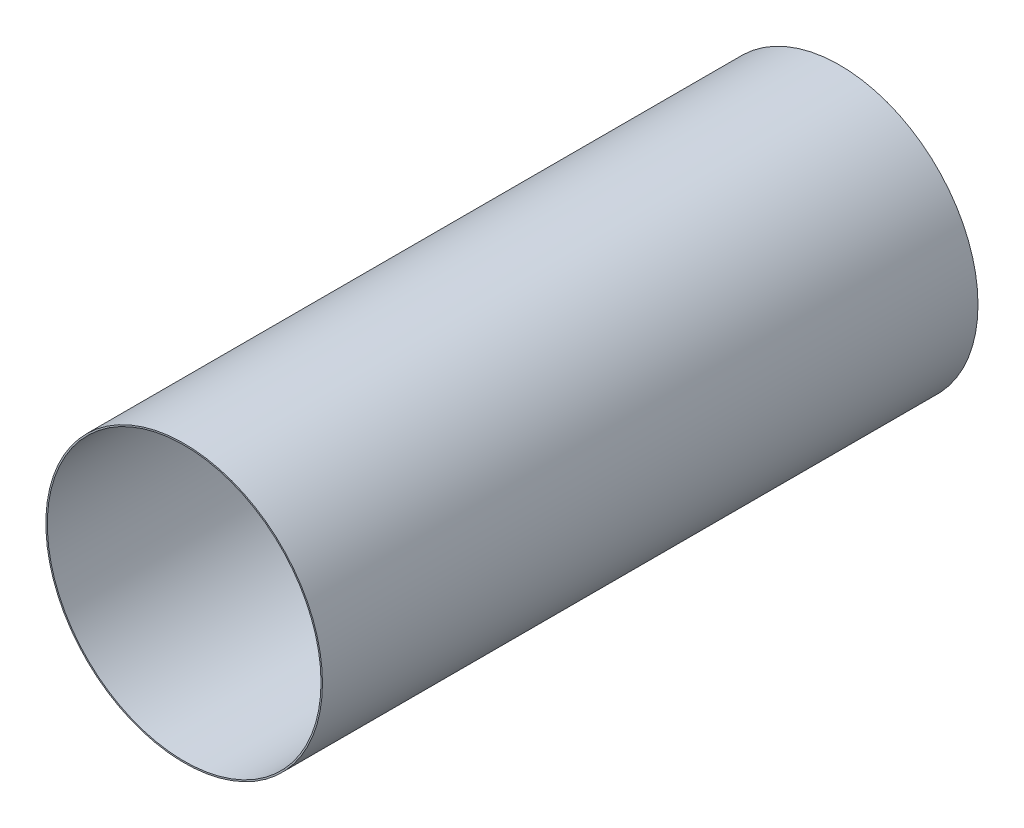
from build123d import *

# Parameters (mm, degrees)
SKETCH1_R           = 19.2
SKETCH1_R_2         = 19
BOSS_EXTRUDE1_DEPTH = 91


with BuildPart() as part:
    # Sketch1 → Boss-Extrude1 (new body)
    with BuildSketch(Plane.XY):
        Circle(SKETCH1_R)
        Circle(SKETCH1_R_2, mode=Mode.SUBTRACT)
    extrude(amount=-BOSS_EXTRUDE1_DEPTH)


solid = part.part
